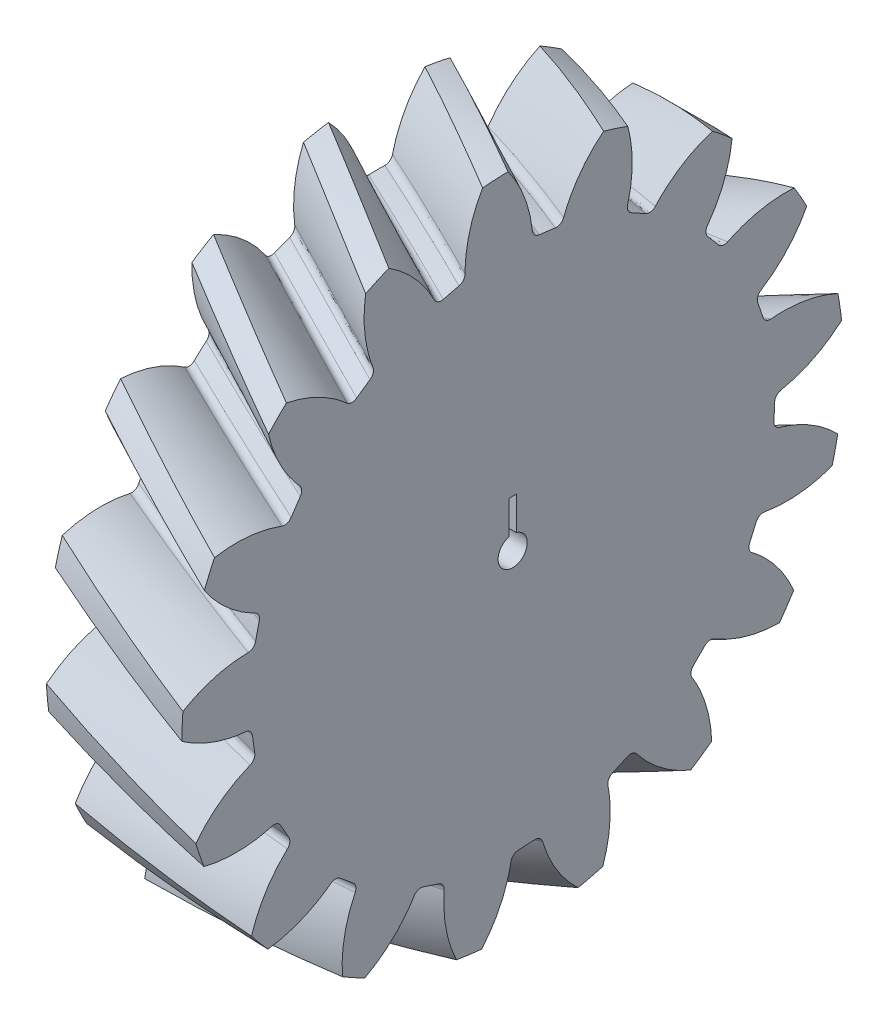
from build123d import *

# Parameters (mm, degrees)
BASPROSKE_W            = 44.45
BASPROSKE_H            = 108.149545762
TOOTHCUTRH_PITCH       = 1176.969464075
TOOTHCUTRH_HEIGHT      = 44.45
TOOTHCUTRH_RADIUS      = 108.149545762
TOOTHCUTRH_START_ANGLE = -90
TEETHCUTSRH_COUNT      = 17
TEETHCUTSRH_ANGLE      = 338.823529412
BORSKE_R               = 4.7625
BORE_DEPTH             = 63.5000025
KEYSKE_W               = 2.38252
KEYSKE_H               = 15.47876
KEYWAY_DEPTH           = 63.5000025


with BuildPart() as part:
    # BasProSke → Base-Revolve (revolve)
    with BuildSketch(Plane(origin=(0, 0, 0), x_dir=(1, 0, 0), z_dir=(0, 1, 0)), mode=Mode.PRIVATE) as base_revolve_sk:
        with Locations((22.225, 54.074772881)):
            Rectangle(BASPROSKE_W, BASPROSKE_H)
    revolve(base_revolve_sk.sketch.rotate(Axis((-10, 0, 0), (1, 0, 0)), 180), axis=Axis((-10, 0, 0), (1, 0, 0)))

    # ToothCutRH: sweep along a helix
    with BuildLine() as toothcutrh_path:
        add(Helix(TOOTHCUTRH_PITCH, TOOTHCUTRH_HEIGHT, TOOTHCUTRH_RADIUS, center=(0, 0, 0), direction=(1, 0, 0), mode=Mode.PRIVATE).rotate(Axis((0, 0, 0), (1, 0, 0)), TOOTHCUTRH_START_ANGLE))
    # TooCutSkeRH → ToothCutRH (sweep, cut)
    with BuildSketch(Plane(origin=(0, 0, 0), x_dir=(0, 0, -1), z_dir=(1, 0, 0))):
        with BuildLine():
            ThreePointArc((2.646465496, 85.608649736), (0, 85.649545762), (-2.646465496, 85.608649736))
            ThreePointArc((-2.646465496, 85.608649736), (-4.242297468, 86.121171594), (-5.156240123, 87.526186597))
            ThreePointArc((-5.156240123, 87.526186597), (-10.189401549, 99.734492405), (-18.726787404, 109.808641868))
            ThreePointArc((-18.726787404, 109.808641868), (0, 111.394032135), (18.726787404, 109.808641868))
            ThreePointArc((18.726787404, 109.808641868), (10.189401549, 99.734492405), (5.156240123, 87.526186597))
            ThreePointArc((5.156240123, 87.526186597), (4.242297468, 86.121171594), (2.646465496, 85.608649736))
        make_face()
    toothcutrh = sweep(path=toothcutrh_path.line, is_frenet=True, mode=Mode.SUBTRACT)

    # TeethCutsRH: ToothCutRH ×17 about axis
    teethcutsrh_axis = Axis((-10, 0, 0), (1, 0, 0))
    for i in range(1, TEETHCUTSRH_COUNT):
        add(toothcutrh.rotate(teethcutsrh_axis, i * TEETHCUTSRH_ANGLE / (TEETHCUTSRH_COUNT - 1)), mode=Mode.SUBTRACT)

    # BorSke → Bore (cut, symmetric)
    with BuildSketch(Plane(origin=(0, 0, 0), x_dir=(0, 0, -1), z_dir=(1, 0, 0))):
        with Locations(Location((0, 0, 0), (0, 0, 180))):
            Circle(BORSKE_R)
    extrude(amount=BORE_DEPTH, both=True, mode=Mode.SUBTRACT)

    # KeySke → Keyway (cut, symmetric)
    with BuildSketch(Plane(origin=(0, 0, 0), x_dir=(0, 0, -1), z_dir=(1, 0, 0))):
        with Locations((0, 7.73938)):
            Rectangle(KEYSKE_W, KEYSKE_H)
    extrude(amount=KEYWAY_DEPTH, both=True, mode=Mode.SUBTRACT)


solid = part.part
